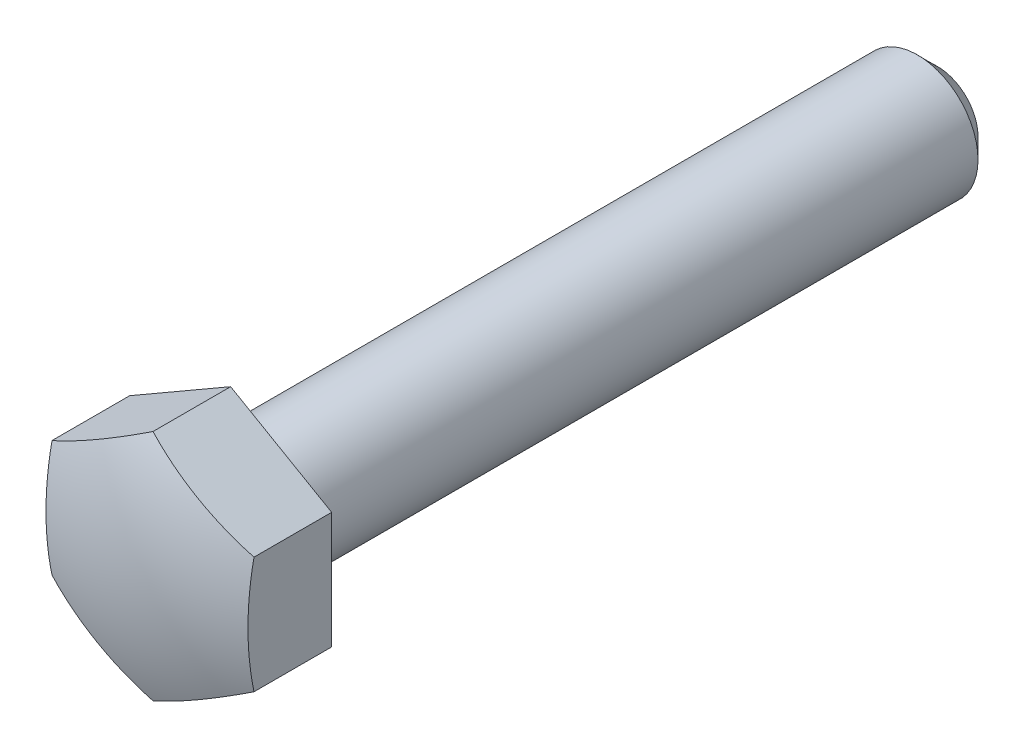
ISO-10303-21;
HEADER;
FILE_DESCRIPTION(('STEP AP214'),'2;1');
FILE_NAME('part.step','',(''),(''),'','','');
FILE_SCHEMA(('AUTOMOTIVE_DESIGN { 1 0 10303 214 1 1 1 1 }'));
ENDSEC;
DATA;
#1=APPLICATION_CONTEXT('core data for automotive mechanical design processes');
#2=APPLICATION_PROTOCOL_DEFINITION('international standard','automotive_design',2000,#1);
#3=PRODUCT_CONTEXT('',#1,'mechanical');
#4=PRODUCT('Part','Part','',(#3));
#5=PRODUCT_RELATED_PRODUCT_CATEGORY('part','',(#4));
#6=PRODUCT_DEFINITION_FORMATION('','',#4);
#7=PRODUCT_DEFINITION_CONTEXT('part definition',#1,'design');
#8=PRODUCT_DEFINITION('design','',#6,#7);
#9=PRODUCT_DEFINITION_SHAPE('','',#8);
#10=(LENGTH_UNIT() NAMED_UNIT(*) SI_UNIT(.MILLI.,.METRE.));
#11=(NAMED_UNIT(*) PLANE_ANGLE_UNIT() SI_UNIT($,.RADIAN.));
#12=(NAMED_UNIT(*) SI_UNIT($,.STERADIAN.) SOLID_ANGLE_UNIT());
#13=UNCERTAINTY_MEASURE_WITH_UNIT(LENGTH_MEASURE(1.E-05),#10,'distance_accuracy_value','');
#14=(GEOMETRIC_REPRESENTATION_CONTEXT(3) GLOBAL_UNCERTAINTY_ASSIGNED_CONTEXT((#13)) GLOBAL_UNIT_ASSIGNED_CONTEXT((#10,
#11,#12)) REPRESENTATION_CONTEXT('',''));
#15=CARTESIAN_POINT('',(0.,0.,0.));
#16=DIRECTION('',(0.,0.,1.));
#17=DIRECTION('',(1.,0.,0.));
#18=AXIS2_PLACEMENT_3D('',#15,#16,#17);
#19=CARTESIAN_POINT('',(3.,0.,0.));
#20=DIRECTION('',(0.,0.,1.));
#21=DIRECTION('',(1.,0.,0.));
#22=AXIS2_PLACEMENT_3D('',#19,#20,#21);
#23=PLANE('',#22);
#24=CARTESIAN_POINT('',(0.,0.,0.));
#25=DIRECTION('',(0.,0.,1.));
#26=DIRECTION('',(1.,0.,0.));
#27=AXIS2_PLACEMENT_3D('',#24,#25,#26);
#28=CIRCLE('',#27,3.);
#29=CARTESIAN_POINT('',(3.,0.,0.));
#30=VERTEX_POINT('',#29);
#31=EDGE_CURVE('E115',#30,#30,#28,.T.);
#32=ORIENTED_EDGE('',*,*,#31,.T.);
#33=EDGE_LOOP('',(#32));
#34=FACE_BOUND('',#33,.T.);
#35=DIRECTION('',(-0.86602540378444,-0.5,0.));
#36=VECTOR('',#35,1.);
#37=CARTESIAN_POINT('',(5.,-2.88675134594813,0.));
#38=LINE('',#37,#36);
#39=CARTESIAN_POINT('',(5.,-2.88675134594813,0.));
#40=VERTEX_POINT('',#39);
#41=CARTESIAN_POINT('',(0.,-5.77350269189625,0.));
#42=VERTEX_POINT('',#41);
#43=EDGE_CURVE('E89',#40,#42,#38,.T.);
#44=ORIENTED_EDGE('',*,*,#43,.T.);
#45=DIRECTION('',(0.86602540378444,-0.5,0.));
#46=VECTOR('',#45,1.);
#47=CARTESIAN_POINT('',(-5.,-2.88675134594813,0.));
#48=LINE('',#47,#46);
#49=CARTESIAN_POINT('',(-5.,-2.88675134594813,0.));
#50=VERTEX_POINT('',#49);
#51=EDGE_CURVE('E87',#50,#42,#48,.T.);
#52=ORIENTED_EDGE('',*,*,#51,.F.);
#53=DIRECTION('',(0.,-1.,0.));
#54=VECTOR('',#53,1.);
#55=CARTESIAN_POINT('',(-5.,2.88675134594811,0.));
#56=LINE('',#55,#54);
#57=CARTESIAN_POINT('',(-5.,2.88675134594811,0.));
#58=VERTEX_POINT('',#57);
#59=EDGE_CURVE('E37',#58,#50,#56,.T.);
#60=ORIENTED_EDGE('',*,*,#59,.F.);
#61=DIRECTION('',(0.866025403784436,0.5,0.));
#62=VECTOR('',#61,1.);
#63=CARTESIAN_POINT('',(-5.,2.88675134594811,0.));
#64=LINE('',#63,#62);
#65=CARTESIAN_POINT('',(0.,5.77350269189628,0.));
#66=VERTEX_POINT('',#65);
#67=EDGE_CURVE('E77',#58,#66,#64,.T.);
#68=ORIENTED_EDGE('',*,*,#67,.T.);
#69=DIRECTION('',(-0.866025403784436,0.5,0.));
#70=VECTOR('',#69,1.);
#71=CARTESIAN_POINT('',(5.,2.88675134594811,0.));
#72=LINE('',#71,#70);
#73=CARTESIAN_POINT('',(5.,2.88675134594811,0.));
#74=VERTEX_POINT('',#73);
#75=EDGE_CURVE('E83',#74,#66,#72,.T.);
#76=ORIENTED_EDGE('',*,*,#75,.F.);
#77=DIRECTION('',(0.,-1.,0.));
#78=VECTOR('',#77,1.);
#79=CARTESIAN_POINT('',(5.,2.88675134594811,0.));
#80=LINE('',#79,#78);
#81=EDGE_CURVE('E95',#74,#40,#80,.T.);
#82=ORIENTED_EDGE('',*,*,#81,.T.);
#83=EDGE_LOOP('',(#44,#52,#60,#68,#76,#82));
#84=FACE_BOUND('',#83,.T.);
#85=ADVANCED_FACE('F14',(#34,#84),#23,.F.);
#86=CARTESIAN_POINT('',(0.,0.,25.));
#87=DIRECTION('',(0.,0.,1.));
#88=DIRECTION('',(1.,0.,0.));
#89=AXIS2_PLACEMENT_3D('',#86,#87,#88);
#90=CYLINDRICAL_SURFACE('',#89,3.);
#91=CARTESIAN_POINT('',(0.,0.,-34.));
#92=DIRECTION('',(0.,0.,1.));
#93=DIRECTION('',(1.,0.,0.));
#94=AXIS2_PLACEMENT_3D('',#91,#92,#93);
#95=CIRCLE('',#94,3.);
#96=CARTESIAN_POINT('',(3.,0.,-34.));
#97=VERTEX_POINT('',#96);
#98=EDGE_CURVE('E22',#97,#97,#95,.T.);
#99=ORIENTED_EDGE('',*,*,#98,.T.);
#100=EDGE_LOOP('',(#99));
#101=FACE_BOUND('',#100,.T.);
#102=ORIENTED_EDGE('',*,*,#31,.F.);
#103=EDGE_LOOP('',(#102));
#104=FACE_BOUND('',#103,.T.);
#105=ADVANCED_FACE('F120',(#101,#104),#90,.T.);
#106=CARTESIAN_POINT('',(0.,0.,-35.));
#107=DIRECTION('',(0.,0.,1.));
#108=DIRECTION('',(1.,0.,0.));
#109=AXIS2_PLACEMENT_3D('',#106,#107,#108);
#110=PLANE('',#109);
#111=CARTESIAN_POINT('',(0.,0.,-35.));
#112=DIRECTION('',(0.,0.,1.));
#113=DIRECTION('',(1.,0.,0.));
#114=AXIS2_PLACEMENT_3D('',#111,#112,#113);
#115=CIRCLE('',#114,2.);
#116=CARTESIAN_POINT('',(2.,0.,-35.));
#117=VERTEX_POINT('',#116);
#118=EDGE_CURVE('E9',#117,#117,#115,.F.);
#119=ORIENTED_EDGE('',*,*,#118,.T.);
#120=EDGE_LOOP('',(#119));
#121=FACE_BOUND('',#120,.T.);
#122=ADVANCED_FACE('F141',(#121),#110,.F.);
#123=CARTESIAN_POINT('',(5.,-2.88675134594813,5.));
#124=DIRECTION('',(0.5,-0.86602540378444,0.));
#125=DIRECTION('',(0.86602540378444,0.5,0.));
#126=AXIS2_PLACEMENT_3D('',#123,#124,#125);
#127=PLANE('',#126);
#128=DIRECTION('',(0.,0.,-1.));
#129=VECTOR('',#128,1.);
#130=CARTESIAN_POINT('',(0.,-5.77350269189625,5.));
#131=LINE('',#130,#129);
#132=CARTESIAN_POINT('',(0.,-5.77350269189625,3.84437310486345));
#133=VERTEX_POINT('',#132);
#134=EDGE_CURVE('E29',#133,#42,#131,.T.);
#135=ORIENTED_EDGE('',*,*,#134,.T.);
#136=ORIENTED_EDGE('',*,*,#43,.F.);
#137=DIRECTION('',(0.,0.,-1.));
#138=VECTOR('',#137,1.);
#139=CARTESIAN_POINT('',(5.,-2.88675134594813,5.));
#140=LINE('',#139,#138);
#141=CARTESIAN_POINT('',(5.,-2.88675134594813,3.84437310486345));
#142=VERTEX_POINT('',#141);
#143=EDGE_CURVE('E100',#142,#40,#140,.T.);
#144=ORIENTED_EDGE('',*,*,#143,.F.);
#145=CARTESIAN_POINT('',(2.5,-4.3301270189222,-10.));
#146=DIRECTION('',(0.5,-0.86602540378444,0.));
#147=DIRECTION('',(0.86602540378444,0.5,0.));
#148=AXIS2_PLACEMENT_3D('',#145,#146,#147);
#149=CIRCLE('',#148,14.1421356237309);
#150=EDGE_CURVE('E112',#133,#142,#149,.F.);
#151=ORIENTED_EDGE('',*,*,#150,.F.);
#152=EDGE_LOOP('',(#135,#136,#144,#151));
#153=FACE_BOUND('',#152,.T.);
#154=ADVANCED_FACE('F146',(#153),#127,.T.);
#155=CARTESIAN_POINT('',(5.,2.88675134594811,5.));
#156=DIRECTION('',(1.,0.,0.));
#157=DIRECTION('',(0.,0.,-1.));
#158=AXIS2_PLACEMENT_3D('',#155,#156,#157);
#159=PLANE('',#158);
#160=ORIENTED_EDGE('',*,*,#143,.T.);
#161=ORIENTED_EDGE('',*,*,#81,.F.);
#162=DIRECTION('',(0.,0.,-1.));
#163=VECTOR('',#162,1.);
#164=CARTESIAN_POINT('',(5.,2.88675134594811,5.));
#165=LINE('',#164,#163);
#166=CARTESIAN_POINT('',(5.,2.88675134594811,3.84437310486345));
#167=VERTEX_POINT('',#166);
#168=EDGE_CURVE('E98',#167,#74,#165,.T.);
#169=ORIENTED_EDGE('',*,*,#168,.F.);
#170=CARTESIAN_POINT('',(5.,0.,-10.));
#171=DIRECTION('',(1.,0.,0.));
#172=DIRECTION('',(0.,0.,-1.));
#173=AXIS2_PLACEMENT_3D('',#170,#171,#172);
#174=CIRCLE('',#173,14.1421356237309);
#175=EDGE_CURVE('E109',#142,#167,#174,.F.);
#176=ORIENTED_EDGE('',*,*,#175,.F.);
#177=EDGE_LOOP('',(#160,#161,#169,#176));
#178=FACE_BOUND('',#177,.T.);
#179=ADVANCED_FACE('F148',(#178),#159,.T.);
#180=CARTESIAN_POINT('',(5.,2.88675134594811,5.));
#181=DIRECTION('',(-0.5,-0.866025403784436,0.));
#182=DIRECTION('',(0.866025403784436,-0.5,0.));
#183=AXIS2_PLACEMENT_3D('',#180,#181,#182);
#184=PLANE('',#183);
#185=CARTESIAN_POINT('',(2.5,4.33012701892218,-10.));
#186=DIRECTION('',(-0.5,-0.866025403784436,0.));
#187=DIRECTION('',(0.866025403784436,-0.5,0.));
#188=AXIS2_PLACEMENT_3D('',#185,#186,#187);
#189=CIRCLE('',#188,14.1421356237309);
#190=CARTESIAN_POINT('',(0.,5.77350269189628,3.84437310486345));
#191=VERTEX_POINT('',#190);
#192=EDGE_CURVE('E107',#191,#167,#189,.F.);
#193=ORIENTED_EDGE('',*,*,#192,.T.);
#194=ORIENTED_EDGE('',*,*,#168,.T.);
#195=ORIENTED_EDGE('',*,*,#75,.T.);
#196=DIRECTION('',(0.,0.,-1.));
#197=VECTOR('',#196,1.);
#198=CARTESIAN_POINT('',(0.,5.77350269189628,5.));
#199=LINE('',#198,#197);
#200=EDGE_CURVE('E73',#191,#66,#199,.T.);
#201=ORIENTED_EDGE('',*,*,#200,.F.);
#202=EDGE_LOOP('',(#193,#194,#195,#201));
#203=FACE_BOUND('',#202,.T.);
#204=ADVANCED_FACE('F151',(#203),#184,.F.);
#205=CARTESIAN_POINT('',(-5.,2.88675134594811,5.));
#206=DIRECTION('',(-0.5,0.866025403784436,0.));
#207=DIRECTION('',(-0.866025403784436,-0.5,0.));
#208=AXIS2_PLACEMENT_3D('',#205,#206,#207);
#209=PLANE('',#208);
#210=ORIENTED_EDGE('',*,*,#200,.T.);
#211=ORIENTED_EDGE('',*,*,#67,.F.);
#212=DIRECTION('',(0.,0.,-1.));
#213=VECTOR('',#212,1.);
#214=CARTESIAN_POINT('',(-5.,2.88675134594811,5.));
#215=LINE('',#214,#213);
#216=CARTESIAN_POINT('',(-5.,2.88675134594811,3.84437310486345));
#217=VERTEX_POINT('',#216);
#218=EDGE_CURVE('E66',#217,#58,#215,.T.);
#219=ORIENTED_EDGE('',*,*,#218,.F.);
#220=CARTESIAN_POINT('',(-2.5,4.33012701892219,-10.));
#221=DIRECTION('',(-0.5,0.866025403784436,0.));
#222=DIRECTION('',(-0.866025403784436,-0.5,0.));
#223=AXIS2_PLACEMENT_3D('',#220,#221,#222);
#224=CIRCLE('',#223,14.1421356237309);
#225=EDGE_CURVE('E105',#191,#217,#224,.F.);
#226=ORIENTED_EDGE('',*,*,#225,.F.);
#227=EDGE_LOOP('',(#210,#211,#219,#226));
#228=FACE_BOUND('',#227,.T.);
#229=ADVANCED_FACE('F78',(#228),#209,.T.);
#230=CARTESIAN_POINT('',(-5.,2.88675134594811,5.));
#231=DIRECTION('',(1.,0.,0.));
#232=DIRECTION('',(0.,1.,0.));
#233=AXIS2_PLACEMENT_3D('',#230,#231,#232);
#234=PLANE('',#233);
#235=CARTESIAN_POINT('',(-5.,0.,-10.));
#236=DIRECTION('',(1.,0.,0.));
#237=DIRECTION('',(0.,1.,0.));
#238=AXIS2_PLACEMENT_3D('',#235,#236,#237);
#239=CIRCLE('',#238,14.1421356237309);
#240=CARTESIAN_POINT('',(-5.,-2.88675134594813,3.84437310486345));
#241=VERTEX_POINT('',#240);
#242=EDGE_CURVE('E70',#241,#217,#239,.F.);
#243=ORIENTED_EDGE('',*,*,#242,.T.);
#244=ORIENTED_EDGE('',*,*,#218,.T.);
#245=ORIENTED_EDGE('',*,*,#59,.T.);
#246=DIRECTION('',(0.,0.,-1.));
#247=VECTOR('',#246,1.);
#248=CARTESIAN_POINT('',(-5.,-2.88675134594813,5.));
#249=LINE('',#248,#247);
#250=EDGE_CURVE('E74',#241,#50,#249,.T.);
#251=ORIENTED_EDGE('',*,*,#250,.F.);
#252=EDGE_LOOP('',(#243,#244,#245,#251));
#253=FACE_BOUND('',#252,.T.);
#254=ADVANCED_FACE('F68',(#253),#234,.F.);
#255=CARTESIAN_POINT('',(-5.,-2.88675134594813,5.));
#256=DIRECTION('',(0.5,0.86602540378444,0.));
#257=DIRECTION('',(-0.86602540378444,0.5,0.));
#258=AXIS2_PLACEMENT_3D('',#255,#256,#257);
#259=PLANE('',#258);
#260=CARTESIAN_POINT('',(-2.5,-4.3301270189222,-10.));
#261=DIRECTION('',(0.5,0.86602540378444,0.));
#262=DIRECTION('',(-0.86602540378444,0.5,0.));
#263=AXIS2_PLACEMENT_3D('',#260,#261,#262);
#264=CIRCLE('',#263,14.1421356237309);
#265=EDGE_CURVE('E102',#133,#241,#264,.F.);
#266=ORIENTED_EDGE('',*,*,#265,.T.);
#267=ORIENTED_EDGE('',*,*,#250,.T.);
#268=ORIENTED_EDGE('',*,*,#51,.T.);
#269=ORIENTED_EDGE('',*,*,#134,.F.);
#270=EDGE_LOOP('',(#266,#267,#268,#269));
#271=FACE_BOUND('',#270,.T.);
#272=ADVANCED_FACE('F131',(#271),#259,.F.);
#273=CARTESIAN_POINT('',(0.,0.,-10.));
#274=DIRECTION('',(0.,0.,1.));
#275=DIRECTION('',(1.,0.,0.));
#276=AXIS2_PLACEMENT_3D('',#273,#274,#275);
#277=SPHERICAL_SURFACE('',#276,15.);
#278=ORIENTED_EDGE('',*,*,#265,.F.);
#279=ORIENTED_EDGE('',*,*,#150,.T.);
#280=ORIENTED_EDGE('',*,*,#175,.T.);
#281=ORIENTED_EDGE('',*,*,#192,.F.);
#282=ORIENTED_EDGE('',*,*,#225,.T.);
#283=ORIENTED_EDGE('',*,*,#242,.F.);
#284=EDGE_LOOP('',(#278,#279,#280,#281,#282,#283));
#285=FACE_BOUND('',#284,.T.);
#286=ADVANCED_FACE('F124',(#285),#277,.T.);
#287=CARTESIAN_POINT('',(0.,0.,-34.));
#288=DIRECTION('',(0.,0.,1.));
#289=DIRECTION('',(1.,0.,0.));
#290=AXIS2_PLACEMENT_3D('',#287,#288,#289);
#291=CONICAL_SURFACE('',#290,3.,0.785398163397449);
#292=ORIENTED_EDGE('',*,*,#118,.F.);
#293=EDGE_LOOP('',(#292));
#294=FACE_BOUND('',#293,.T.);
#295=ORIENTED_EDGE('',*,*,#98,.F.);
#296=EDGE_LOOP('',(#295));
#297=FACE_BOUND('',#296,.T.);
#298=ADVANCED_FACE('F16',(#294,#297),#291,.T.);
#299=CLOSED_SHELL('',(#85,#105,#122,#154,#179,#204,#229,#254,#272,#286,#298));
#300=MANIFOLD_SOLID_BREP('B1',#299);
#301=ADVANCED_BREP_SHAPE_REPRESENTATION('',(#18,#300),#14);
#302=SHAPE_DEFINITION_REPRESENTATION(#9,#301);
ENDSEC;
END-ISO-10303-21;
